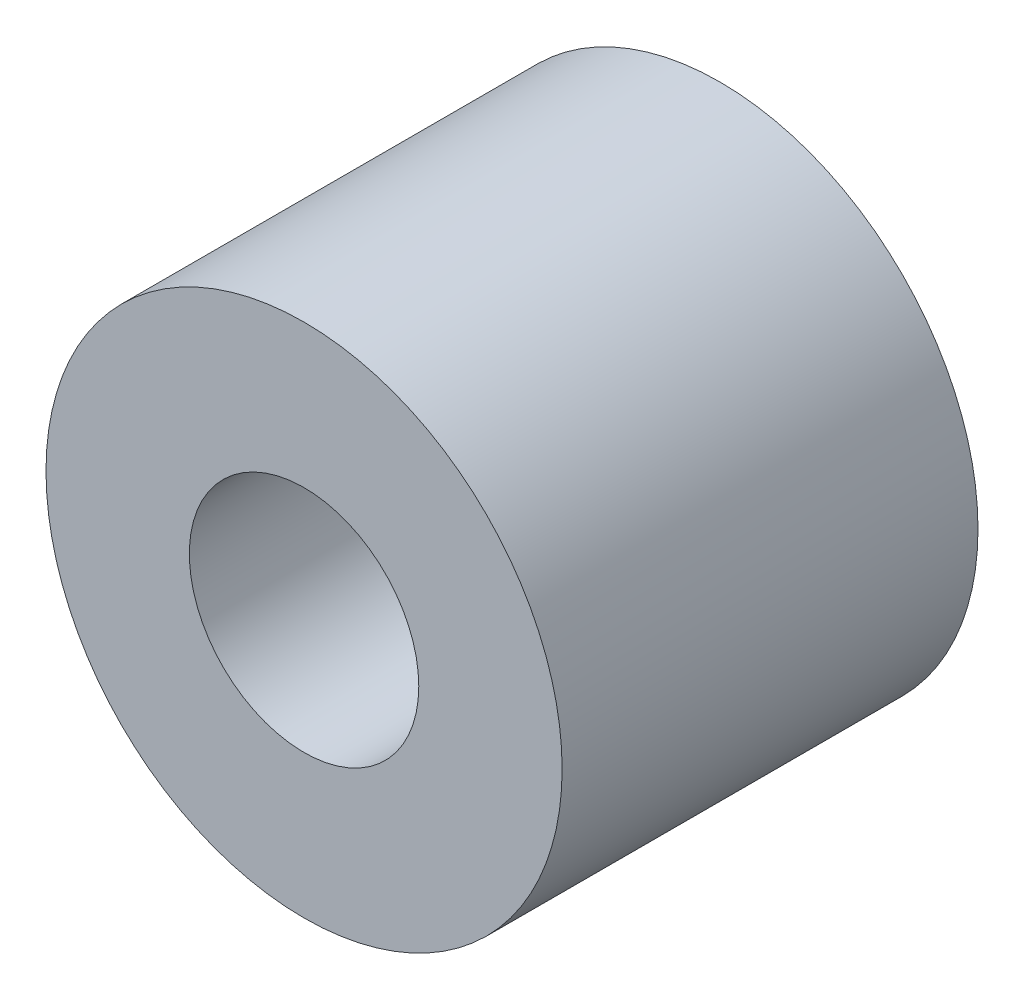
ISO-10303-21;
HEADER;
FILE_DESCRIPTION(('STEP AP214'),'2;1');
FILE_NAME('part.step','',(''),(''),'','','');
FILE_SCHEMA(('AUTOMOTIVE_DESIGN { 1 0 10303 214 1 1 1 1 }'));
ENDSEC;
DATA;
#1=APPLICATION_CONTEXT('core data for automotive mechanical design processes');
#2=APPLICATION_PROTOCOL_DEFINITION('international standard','automotive_design',2000,#1);
#3=PRODUCT_CONTEXT('',#1,'mechanical');
#4=PRODUCT('Part','Part','',(#3));
#5=PRODUCT_RELATED_PRODUCT_CATEGORY('part','',(#4));
#6=PRODUCT_DEFINITION_FORMATION('','',#4);
#7=PRODUCT_DEFINITION_CONTEXT('part definition',#1,'design');
#8=PRODUCT_DEFINITION('design','',#6,#7);
#9=PRODUCT_DEFINITION_SHAPE('','',#8);
#10=(LENGTH_UNIT() NAMED_UNIT(*) SI_UNIT(.MILLI.,.METRE.));
#11=(NAMED_UNIT(*) PLANE_ANGLE_UNIT() SI_UNIT($,.RADIAN.));
#12=(NAMED_UNIT(*) SI_UNIT($,.STERADIAN.) SOLID_ANGLE_UNIT());
#13=UNCERTAINTY_MEASURE_WITH_UNIT(LENGTH_MEASURE(1.E-05),#10,'distance_accuracy_value','');
#14=(GEOMETRIC_REPRESENTATION_CONTEXT(3) GLOBAL_UNCERTAINTY_ASSIGNED_CONTEXT((#13)) GLOBAL_UNIT_ASSIGNED_CONTEXT((#10,
#11,#12)) REPRESENTATION_CONTEXT('',''));
#15=CARTESIAN_POINT('',(0.,0.,0.));
#16=DIRECTION('',(0.,0.,1.));
#17=DIRECTION('',(1.,0.,0.));
#18=AXIS2_PLACEMENT_3D('',#15,#16,#17);
#19=CARTESIAN_POINT('',(0.,0.,39.9496816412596));
#20=DIRECTION('',(0.,0.,-1.));
#21=DIRECTION('',(-1.,0.,0.));
#22=AXIS2_PLACEMENT_3D('',#19,#20,#21);
#23=CYLINDRICAL_SURFACE('',#22,8.99782123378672);
#24=CARTESIAN_POINT('',(0.,0.,0.));
#25=DIRECTION('',(0.,0.,1.));
#26=DIRECTION('',(1.,0.,0.));
#27=AXIS2_PLACEMENT_3D('',#24,#25,#26);
#28=CIRCLE('',#27,8.99782123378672);
#29=CARTESIAN_POINT('',(8.99782123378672,0.,0.));
#30=VERTEX_POINT('',#29);
#31=EDGE_CURVE('E39',#30,#30,#28,.T.);
#32=ORIENTED_EDGE('',*,*,#31,.T.);
#33=EDGE_LOOP('',(#32));
#34=FACE_BOUND('',#33,.T.);
#35=CARTESIAN_POINT('',(0.,0.,14.5));
#36=DIRECTION('',(0.,0.,1.));
#37=DIRECTION('',(1.,0.,0.));
#38=AXIS2_PLACEMENT_3D('',#35,#36,#37);
#39=CIRCLE('',#38,8.99782123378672);
#40=CARTESIAN_POINT('',(8.99782123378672,0.,14.5));
#41=VERTEX_POINT('',#40);
#42=EDGE_CURVE('E10',#41,#41,#39,.T.);
#43=ORIENTED_EDGE('',*,*,#42,.F.);
#44=EDGE_LOOP('',(#43));
#45=FACE_BOUND('',#44,.T.);
#46=ADVANCED_FACE('F32',(#34,#45),#23,.T.);
#47=CARTESIAN_POINT('',(0.,0.,0.));
#48=DIRECTION('',(0.,0.,1.));
#49=DIRECTION('',(1.,0.,0.));
#50=AXIS2_PLACEMENT_3D('',#47,#48,#49);
#51=PLANE('',#50);
#52=ORIENTED_EDGE('',*,*,#31,.F.);
#53=EDGE_LOOP('',(#52));
#54=FACE_BOUND('',#53,.T.);
#55=CARTESIAN_POINT('',(0.,0.,0.));
#56=DIRECTION('',(0.,0.,1.));
#57=DIRECTION('',(1.,0.,0.));
#58=AXIS2_PLACEMENT_3D('',#55,#56,#57);
#59=CIRCLE('',#58,3.99999999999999);
#60=CARTESIAN_POINT('',(3.99999999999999,0.,0.));
#61=VERTEX_POINT('',#60);
#62=EDGE_CURVE('E44',#61,#61,#59,.T.);
#63=ORIENTED_EDGE('',*,*,#62,.T.);
#64=EDGE_LOOP('',(#63));
#65=FACE_BOUND('',#64,.T.);
#66=ADVANCED_FACE('F60',(#54,#65),#51,.F.);
#67=CARTESIAN_POINT('',(0.,0.,39.9496816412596));
#68=DIRECTION('',(0.,0.,-1.));
#69=DIRECTION('',(-1.,0.,0.));
#70=AXIS2_PLACEMENT_3D('',#67,#68,#69);
#71=CYLINDRICAL_SURFACE('',#70,3.99999999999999);
#72=ORIENTED_EDGE('',*,*,#62,.F.);
#73=EDGE_LOOP('',(#72));
#74=FACE_BOUND('',#73,.T.);
#75=CARTESIAN_POINT('',(0.,0.,14.5));
#76=DIRECTION('',(0.,0.,1.));
#77=DIRECTION('',(1.,0.,0.));
#78=AXIS2_PLACEMENT_3D('',#75,#76,#77);
#79=CIRCLE('',#78,3.99999999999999);
#80=CARTESIAN_POINT('',(3.99999999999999,0.,14.5));
#81=VERTEX_POINT('',#80);
#82=EDGE_CURVE('E35',#81,#81,#79,.T.);
#83=ORIENTED_EDGE('',*,*,#82,.T.);
#84=EDGE_LOOP('',(#83));
#85=FACE_BOUND('',#84,.T.);
#86=ADVANCED_FACE('F52',(#74,#85),#71,.F.);
#87=CARTESIAN_POINT('',(-9.49999999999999,0.,14.5));
#88=DIRECTION('',(0.,0.,1.));
#89=DIRECTION('',(1.,0.,0.));
#90=AXIS2_PLACEMENT_3D('',#87,#88,#89);
#91=PLANE('',#90);
#92=ORIENTED_EDGE('',*,*,#82,.F.);
#93=EDGE_LOOP('',(#92));
#94=FACE_BOUND('',#93,.T.);
#95=ORIENTED_EDGE('',*,*,#42,.T.);
#96=EDGE_LOOP('',(#95));
#97=FACE_BOUND('',#96,.T.);
#98=ADVANCED_FACE('F54',(#94,#97),#91,.T.);
#99=CLOSED_SHELL('',(#46,#66,#86,#98));
#100=MANIFOLD_SOLID_BREP('B2',#99);
#101=ADVANCED_BREP_SHAPE_REPRESENTATION('',(#18,#100),#14);
#102=SHAPE_DEFINITION_REPRESENTATION(#9,#101);
ENDSEC;
END-ISO-10303-21;
